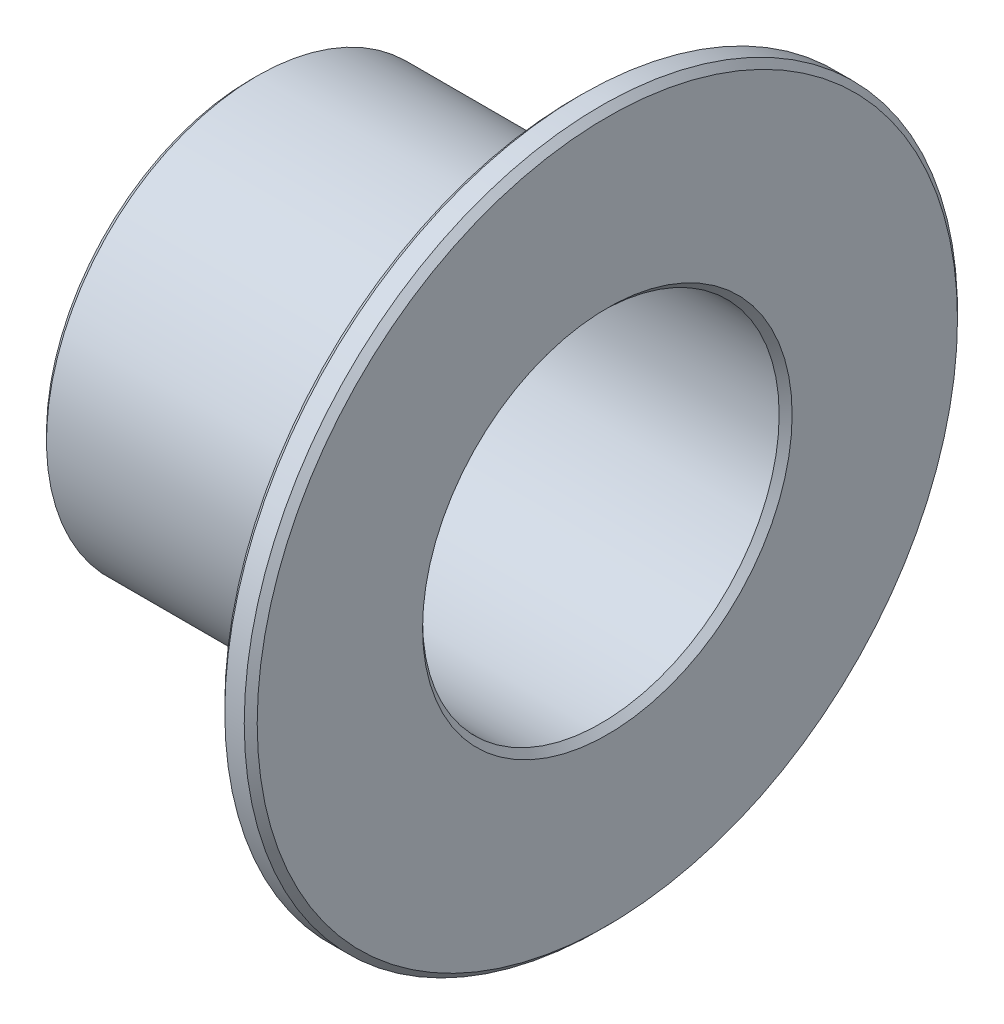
ISO-10303-21;
HEADER;
FILE_DESCRIPTION(('STEP AP214'),'2;1');
FILE_NAME('part.step','',(''),(''),'','','');
FILE_SCHEMA(('AUTOMOTIVE_DESIGN { 1 0 10303 214 1 1 1 1 }'));
ENDSEC;
DATA;
#1=APPLICATION_CONTEXT('core data for automotive mechanical design processes');
#2=APPLICATION_PROTOCOL_DEFINITION('international standard','automotive_design',2000,#1);
#3=PRODUCT_CONTEXT('',#1,'mechanical');
#4=PRODUCT('Part','Part','',(#3));
#5=PRODUCT_RELATED_PRODUCT_CATEGORY('part','',(#4));
#6=PRODUCT_DEFINITION_FORMATION('','',#4);
#7=PRODUCT_DEFINITION_CONTEXT('part definition',#1,'design');
#8=PRODUCT_DEFINITION('design','',#6,#7);
#9=PRODUCT_DEFINITION_SHAPE('','',#8);
#10=(LENGTH_UNIT() NAMED_UNIT(*) SI_UNIT(.MILLI.,.METRE.));
#11=(NAMED_UNIT(*) PLANE_ANGLE_UNIT() SI_UNIT($,.RADIAN.));
#12=(NAMED_UNIT(*) SI_UNIT($,.STERADIAN.) SOLID_ANGLE_UNIT());
#13=UNCERTAINTY_MEASURE_WITH_UNIT(LENGTH_MEASURE(1.E-05),#10,'distance_accuracy_value','');
#14=(GEOMETRIC_REPRESENTATION_CONTEXT(3) GLOBAL_UNCERTAINTY_ASSIGNED_CONTEXT((#13)) GLOBAL_UNIT_ASSIGNED_CONTEXT((#10,
#11,#12)) REPRESENTATION_CONTEXT('',''));
#15=CARTESIAN_POINT('',(0.,0.,0.));
#16=DIRECTION('',(0.,0.,1.));
#17=DIRECTION('',(1.,0.,0.));
#18=AXIS2_PLACEMENT_3D('',#15,#16,#17);
#19=CARTESIAN_POINT('',(0.,0.,0.));
#20=DIRECTION('',(-1.,0.,0.));
#21=DIRECTION('',(0.,0.,1.));
#22=AXIS2_PLACEMENT_3D('',#19,#20,#21);
#23=CYLINDRICAL_SURFACE('',#22,3.25);
#24=CARTESIAN_POINT('',(4.9,0.,0.));
#25=DIRECTION('',(1.,0.,0.));
#26=DIRECTION('',(0.,0.,-1.));
#27=AXIS2_PLACEMENT_3D('',#24,#25,#26);
#28=CIRCLE('',#27,3.25);
#29=CARTESIAN_POINT('',(4.9,0.,-3.25));
#30=VERTEX_POINT('',#29);
#31=EDGE_CURVE('E162',#30,#30,#28,.F.);
#32=ORIENTED_EDGE('',*,*,#31,.T.);
#33=EDGE_LOOP('',(#32));
#34=FACE_BOUND('',#33,.T.);
#35=CARTESIAN_POINT('',(0.0999999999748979,0.,0.));
#36=DIRECTION('',(1.,0.,0.));
#37=DIRECTION('',(0.,0.,-1.));
#38=AXIS2_PLACEMENT_3D('',#35,#36,#37);
#39=CIRCLE('',#38,3.24999999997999);
#40=CARTESIAN_POINT('',(0.0999999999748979,0.,-3.24999999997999));
#41=VERTEX_POINT('',#40);
#42=EDGE_CURVE('E40',#41,#41,#39,.F.);
#43=ORIENTED_EDGE('',*,*,#42,.F.);
#44=EDGE_LOOP('',(#43));
#45=FACE_BOUND('',#44,.T.);
#46=ADVANCED_FACE('F17',(#34,#45),#23,.T.);
#47=CARTESIAN_POINT('',(4.9,0.,0.));
#48=DIRECTION('',(1.,0.,0.));
#49=DIRECTION('',(0.,0.,-1.));
#50=AXIS2_PLACEMENT_3D('',#47,#48,#49);
#51=TOROIDAL_SURFACE('',#50,3.35,0.1);
#52=CARTESIAN_POINT('',(5.,0.,0.));
#53=DIRECTION('',(-1.,0.,0.));
#54=DIRECTION('',(0.,0.,1.));
#55=AXIS2_PLACEMENT_3D('',#52,#53,#54);
#56=CIRCLE('',#55,3.35);
#57=CARTESIAN_POINT('',(5.,0.,3.35));
#58=VERTEX_POINT('',#57);
#59=CARTESIAN_POINT('',(5.,0.,-3.35));
#60=VERTEX_POINT('',#59);
#61=EDGE_CURVE('E33',#58,#60,#56,.T.);
#62=ORIENTED_EDGE('',*,*,#61,.T.);
#63=CARTESIAN_POINT('',(5.,0.,0.));
#64=DIRECTION('',(-1.,0.,0.));
#65=DIRECTION('',(0.,0.,-1.));
#66=AXIS2_PLACEMENT_3D('',#63,#64,#65);
#67=CIRCLE('',#66,3.35);
#68=EDGE_CURVE('E36',#60,#58,#67,.T.);
#69=ORIENTED_EDGE('',*,*,#68,.T.);
#70=EDGE_LOOP('',(#62,#69));
#71=FACE_BOUND('',#70,.T.);
#72=ORIENTED_EDGE('',*,*,#31,.F.);
#73=EDGE_LOOP('',(#72));
#74=FACE_BOUND('',#73,.T.);
#75=ADVANCED_FACE('F44',(#71,#74),#51,.F.);
#76=CARTESIAN_POINT('',(0.0999999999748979,0.,0.));
#77=DIRECTION('',(1.,0.,0.));
#78=DIRECTION('',(0.,1.,0.));
#79=AXIS2_PLACEMENT_3D('',#76,#77,#78);
#80=CONICAL_SURFACE('',#79,3.24999999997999,0.785398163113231);
#81=CARTESIAN_POINT('',(0.,0.,0.));
#82=DIRECTION('',(1.,0.,0.));
#83=DIRECTION('',(0.,1.,0.));
#84=AXIS2_PLACEMENT_3D('',#81,#82,#83);
#85=CIRCLE('',#84,3.15000000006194);
#86=CARTESIAN_POINT('',(0.,3.15000000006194,0.));
#87=VERTEX_POINT('',#86);
#88=EDGE_CURVE('E46',#87,#87,#85,.T.);
#89=ORIENTED_EDGE('',*,*,#88,.T.);
#90=EDGE_LOOP('',(#89));
#91=FACE_BOUND('',#90,.T.);
#92=ORIENTED_EDGE('',*,*,#42,.T.);
#93=EDGE_LOOP('',(#92));
#94=FACE_BOUND('',#93,.T.);
#95=ADVANCED_FACE('F63',(#91,#94),#80,.T.);
#96=CARTESIAN_POINT('',(5.,5.5,0.));
#97=DIRECTION('',(1.,0.,0.));
#98=DIRECTION('',(0.,0.,-1.));
#99=AXIS2_PLACEMENT_3D('',#96,#97,#98);
#100=PLANE('',#99);
#101=CARTESIAN_POINT('',(4.99999999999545,0.,0.));
#102=DIRECTION('',(1.,0.,0.));
#103=DIRECTION('',(0.,0.,-1.));
#104=AXIS2_PLACEMENT_3D('',#101,#102,#103);
#105=CIRCLE('',#104,5.40000000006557);
#106=CARTESIAN_POINT('',(4.99999999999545,0.,-5.40000000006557));
#107=VERTEX_POINT('',#106);
#108=EDGE_CURVE('E135',#107,#107,#105,.T.);
#109=ORIENTED_EDGE('',*,*,#108,.F.);
#110=EDGE_LOOP('',(#109));
#111=FACE_BOUND('',#110,.T.);
#112=ORIENTED_EDGE('',*,*,#68,.F.);
#113=ORIENTED_EDGE('',*,*,#61,.F.);
#114=EDGE_LOOP('',(#112,#113));
#115=FACE_BOUND('',#114,.T.);
#116=ADVANCED_FACE('F38',(#111,#115),#100,.F.);
#117=CARTESIAN_POINT('',(0.,3.25,0.));
#118=DIRECTION('',(1.,0.,0.));
#119=DIRECTION('',(0.,0.,-1.));
#120=AXIS2_PLACEMENT_3D('',#117,#118,#119);
#121=PLANE('',#120);
#122=ORIENTED_EDGE('',*,*,#88,.F.);
#123=EDGE_LOOP('',(#122));
#124=FACE_BOUND('',#123,.T.);
#125=CARTESIAN_POINT('',(0.,0.,0.));
#126=DIRECTION('',(-1.,0.,0.));
#127=DIRECTION('',(0.,0.,1.));
#128=AXIS2_PLACEMENT_3D('',#125,#126,#127);
#129=CIRCLE('',#128,2.84999999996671);
#130=CARTESIAN_POINT('',(0.,0.,2.84999999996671));
#131=VERTEX_POINT('',#130);
#132=EDGE_CURVE('E131',#131,#131,#129,.F.);
#133=ORIENTED_EDGE('',*,*,#132,.T.);
#134=EDGE_LOOP('',(#133));
#135=FACE_BOUND('',#134,.T.);
#136=ADVANCED_FACE('F71',(#124,#135),#121,.F.);
#137=CARTESIAN_POINT('',(5.09999999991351,0.,0.));
#138=DIRECTION('',(1.,0.,0.));
#139=DIRECTION('',(0.,0.,-1.));
#140=AXIS2_PLACEMENT_3D('',#137,#138,#139);
#141=CONICAL_SURFACE('',#140,5.49999999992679,0.785398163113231);
#142=ORIENTED_EDGE('',*,*,#108,.T.);
#143=EDGE_LOOP('',(#142));
#144=FACE_BOUND('',#143,.T.);
#145=CARTESIAN_POINT('',(5.1,0.,0.));
#146=DIRECTION('',(-1.,0.,0.));
#147=DIRECTION('',(0.,0.,1.));
#148=AXIS2_PLACEMENT_3D('',#145,#146,#147);
#149=CIRCLE('',#148,5.5);
#150=CARTESIAN_POINT('',(5.1,0.,5.5));
#151=VERTEX_POINT('',#150);
#152=EDGE_CURVE('E134',#151,#151,#149,.F.);
#153=ORIENTED_EDGE('',*,*,#152,.F.);
#154=EDGE_LOOP('',(#153));
#155=FACE_BOUND('',#154,.T.);
#156=ADVANCED_FACE('F90',(#144,#155),#141,.T.);
#157=CARTESIAN_POINT('',(0.,0.,0.));
#158=DIRECTION('',(-1.,0.,0.));
#159=DIRECTION('',(0.,0.,1.));
#160=AXIS2_PLACEMENT_3D('',#157,#158,#159);
#161=CONICAL_SURFACE('',#160,2.84999999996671,0.785398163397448);
#162=ORIENTED_EDGE('',*,*,#132,.F.);
#163=EDGE_LOOP('',(#162));
#164=FACE_BOUND('',#163,.T.);
#165=CARTESIAN_POINT('',(0.0999999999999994,0.,0.));
#166=DIRECTION('',(-1.,0.,0.));
#167=DIRECTION('',(0.,0.,1.));
#168=AXIS2_PLACEMENT_3D('',#165,#166,#167);
#169=CIRCLE('',#168,2.75);
#170=CARTESIAN_POINT('',(0.0999999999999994,0.,2.75));
#171=VERTEX_POINT('',#170);
#172=EDGE_CURVE('E146',#171,#171,#169,.F.);
#173=ORIENTED_EDGE('',*,*,#172,.T.);
#174=EDGE_LOOP('',(#173));
#175=FACE_BOUND('',#174,.T.);
#176=ADVANCED_FACE('F94',(#164,#175),#161,.F.);
#177=CARTESIAN_POINT('',(0.,0.,0.));
#178=DIRECTION('',(-1.,0.,0.));
#179=DIRECTION('',(0.,0.,1.));
#180=AXIS2_PLACEMENT_3D('',#177,#178,#179);
#181=CYLINDRICAL_SURFACE('',#180,5.5);
#182=CARTESIAN_POINT('',(5.40000000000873,0.,0.));
#183=DIRECTION('',(-1.,0.,0.));
#184=DIRECTION('',(0.,0.,1.));
#185=AXIS2_PLACEMENT_3D('',#182,#183,#184);
#186=CIRCLE('',#185,5.50000000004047);
#187=CARTESIAN_POINT('',(5.40000000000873,0.,5.50000000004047));
#188=VERTEX_POINT('',#187);
#189=EDGE_CURVE('E128',#188,#188,#186,.F.);
#190=ORIENTED_EDGE('',*,*,#189,.F.);
#191=EDGE_LOOP('',(#190));
#192=FACE_BOUND('',#191,.T.);
#193=ORIENTED_EDGE('',*,*,#152,.T.);
#194=EDGE_LOOP('',(#193));
#195=FACE_BOUND('',#194,.T.);
#196=ADVANCED_FACE('F98',(#192,#195),#181,.T.);
#197=CARTESIAN_POINT('',(0.,0.,0.));
#198=DIRECTION('',(-1.,0.,0.));
#199=DIRECTION('',(0.,0.,1.));
#200=AXIS2_PLACEMENT_3D('',#197,#198,#199);
#201=CYLINDRICAL_SURFACE('',#200,2.75);
#202=ORIENTED_EDGE('',*,*,#172,.F.);
#203=EDGE_LOOP('',(#202));
#204=FACE_BOUND('',#203,.T.);
#205=CARTESIAN_POINT('',(5.40000000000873,0.,0.));
#206=DIRECTION('',(1.,0.,0.));
#207=DIRECTION('',(0.,0.,-1.));
#208=AXIS2_PLACEMENT_3D('',#205,#206,#207);
#209=CIRCLE('',#208,2.74999999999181);
#210=CARTESIAN_POINT('',(5.40000000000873,0.,-2.74999999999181));
#211=VERTEX_POINT('',#210);
#212=EDGE_CURVE('E125',#211,#211,#209,.T.);
#213=ORIENTED_EDGE('',*,*,#212,.T.);
#214=EDGE_LOOP('',(#213));
#215=FACE_BOUND('',#214,.T.);
#216=ADVANCED_FACE('F102',(#204,#215),#201,.F.);
#217=CARTESIAN_POINT('',(5.40000000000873,0.,0.));
#218=DIRECTION('',(-1.,0.,0.));
#219=DIRECTION('',(0.,0.,1.));
#220=AXIS2_PLACEMENT_3D('',#217,#218,#219);
#221=CONICAL_SURFACE('',#220,5.50000000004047,0.785398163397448);
#222=CARTESIAN_POINT('',(5.50000000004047,0.,0.));
#223=DIRECTION('',(-1.,0.,0.));
#224=DIRECTION('',(0.,0.,1.));
#225=AXIS2_PLACEMENT_3D('',#222,#223,#224);
#226=CIRCLE('',#225,5.40000000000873);
#227=CARTESIAN_POINT('',(5.50000000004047,0.,5.40000000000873));
#228=VERTEX_POINT('',#227);
#229=EDGE_CURVE('E27',#228,#228,#226,.T.);
#230=ORIENTED_EDGE('',*,*,#229,.T.);
#231=EDGE_LOOP('',(#230));
#232=FACE_BOUND('',#231,.T.);
#233=ORIENTED_EDGE('',*,*,#189,.T.);
#234=EDGE_LOOP('',(#233));
#235=FACE_BOUND('',#234,.T.);
#236=ADVANCED_FACE('F106',(#232,#235),#221,.T.);
#237=CARTESIAN_POINT('',(5.49999999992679,0.,0.));
#238=DIRECTION('',(1.,0.,0.));
#239=DIRECTION('',(0.,0.,-1.));
#240=AXIS2_PLACEMENT_3D('',#237,#238,#239);
#241=CONICAL_SURFACE('',#240,2.84999999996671,0.785398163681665);
#242=CARTESIAN_POINT('',(5.49999999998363,0.,0.));
#243=DIRECTION('',(1.,0.,0.));
#244=DIRECTION('',(0.,0.,-1.));
#245=AXIS2_PLACEMENT_3D('',#242,#243,#244);
#246=CIRCLE('',#245,2.85000000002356);
#247=CARTESIAN_POINT('',(5.49999999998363,0.,-2.85000000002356));
#248=VERTEX_POINT('',#247);
#249=EDGE_CURVE('E11',#248,#248,#246,.T.);
#250=ORIENTED_EDGE('',*,*,#249,.T.);
#251=EDGE_LOOP('',(#250));
#252=FACE_BOUND('',#251,.T.);
#253=ORIENTED_EDGE('',*,*,#212,.F.);
#254=EDGE_LOOP('',(#253));
#255=FACE_BOUND('',#254,.T.);
#256=ADVANCED_FACE('F110',(#252,#255),#241,.F.);
#257=CARTESIAN_POINT('',(5.5,2.75,0.));
#258=DIRECTION('',(-1.,0.,0.));
#259=DIRECTION('',(0.,0.,1.));
#260=AXIS2_PLACEMENT_3D('',#257,#258,#259);
#261=PLANE('',#260);
#262=ORIENTED_EDGE('',*,*,#249,.F.);
#263=EDGE_LOOP('',(#262));
#264=FACE_BOUND('',#263,.T.);
#265=ORIENTED_EDGE('',*,*,#229,.F.);
#266=EDGE_LOOP('',(#265));
#267=FACE_BOUND('',#266,.T.);
#268=ADVANCED_FACE('F114',(#264,#267),#261,.F.);
#269=CLOSED_SHELL('',(#46,#75,#95,#116,#136,#156,#176,#196,#216,#236,#256,#268));
#270=MANIFOLD_SOLID_BREP('B1',#269);
#271=ADVANCED_BREP_SHAPE_REPRESENTATION('',(#18,#270),#14);
#272=SHAPE_DEFINITION_REPRESENTATION(#9,#271);
ENDSEC;
END-ISO-10303-21;
